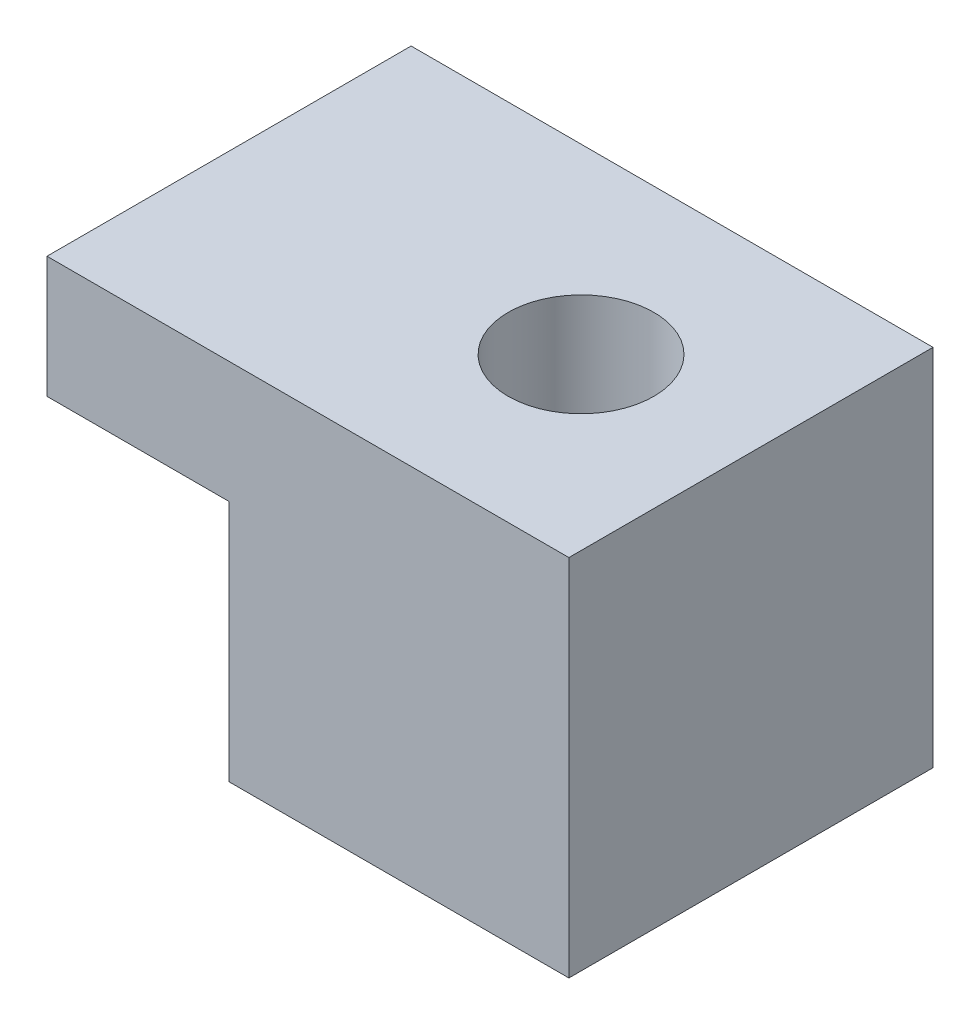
ISO-10303-21;
HEADER;
FILE_DESCRIPTION(('STEP AP214'),'2;1');
FILE_NAME('part.step','',(''),(''),'','','');
FILE_SCHEMA(('AUTOMOTIVE_DESIGN { 1 0 10303 214 1 1 1 1 }'));
ENDSEC;
DATA;
#1=APPLICATION_CONTEXT('core data for automotive mechanical design processes');
#2=APPLICATION_PROTOCOL_DEFINITION('international standard','automotive_design',2000,#1);
#3=PRODUCT_CONTEXT('',#1,'mechanical');
#4=PRODUCT('Part','Part','',(#3));
#5=PRODUCT_RELATED_PRODUCT_CATEGORY('part','',(#4));
#6=PRODUCT_DEFINITION_FORMATION('','',#4);
#7=PRODUCT_DEFINITION_CONTEXT('part definition',#1,'design');
#8=PRODUCT_DEFINITION('design','',#6,#7);
#9=PRODUCT_DEFINITION_SHAPE('','',#8);
#10=(LENGTH_UNIT() NAMED_UNIT(*) SI_UNIT(.MILLI.,.METRE.));
#11=(NAMED_UNIT(*) PLANE_ANGLE_UNIT() SI_UNIT($,.RADIAN.));
#12=(NAMED_UNIT(*) SI_UNIT($,.STERADIAN.) SOLID_ANGLE_UNIT());
#13=UNCERTAINTY_MEASURE_WITH_UNIT(LENGTH_MEASURE(1.E-05),#10,'distance_accuracy_value','');
#14=(GEOMETRIC_REPRESENTATION_CONTEXT(3) GLOBAL_UNCERTAINTY_ASSIGNED_CONTEXT((#13)) GLOBAL_UNIT_ASSIGNED_CONTEXT((#10,
#11,#12)) REPRESENTATION_CONTEXT('',''));
#15=CARTESIAN_POINT('',(0.,0.,0.));
#16=DIRECTION('',(0.,0.,1.));
#17=DIRECTION('',(1.,0.,0.));
#18=AXIS2_PLACEMENT_3D('',#15,#16,#17);
#19=CARTESIAN_POINT('',(14.0000000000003,-2.99760216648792E-12,7.49999999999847));
#20=DIRECTION('',(0.,1.,0.));
#21=DIRECTION('',(-1.,0.,0.));
#22=AXIS2_PLACEMENT_3D('',#19,#20,#21);
#23=PLANE('',#22);
#24=CARTESIAN_POINT('',(6.99999999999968,0.,-1.52655665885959E-12));
#25=DIRECTION('',(0.,1.,0.));
#26=DIRECTION('',(0.,0.,1.));
#27=AXIS2_PLACEMENT_3D('',#24,#25,#26);
#28=CIRCLE('',#27,3.);
#29=CARTESIAN_POINT('',(6.99999999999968,0.,2.99999999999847));
#30=VERTEX_POINT('',#29);
#31=EDGE_CURVE('E86',#30,#30,#28,.T.);
#32=ORIENTED_EDGE('',*,*,#31,.T.);
#33=EDGE_LOOP('',(#32));
#34=FACE_BOUND('',#33,.T.);
#35=DIRECTION('',(1.,0.,0.));
#36=VECTOR('',#35,1.);
#37=CARTESIAN_POINT('',(14.,-2.38697950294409E-12,-7.50000000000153));
#38=LINE('',#37,#36);
#39=CARTESIAN_POINT('',(-1.73472347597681E-13,-7.21644966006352E-13,-7.5));
#40=VERTEX_POINT('',#39);
#41=CARTESIAN_POINT('',(14.,-2.38697950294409E-12,-7.50000000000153));
#42=VERTEX_POINT('',#41);
#43=EDGE_CURVE('E72',#40,#42,#38,.T.);
#44=ORIENTED_EDGE('',*,*,#43,.T.);
#45=DIRECTION('',(0.,0.,-1.));
#46=VECTOR('',#45,1.);
#47=CARTESIAN_POINT('',(14.0000000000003,-2.99760216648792E-12,7.49999999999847));
#48=LINE('',#47,#46);
#49=CARTESIAN_POINT('',(14.0000000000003,-2.99760216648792E-12,7.49999999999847));
#50=VERTEX_POINT('',#49);
#51=EDGE_CURVE('E11',#50,#42,#48,.T.);
#52=ORIENTED_EDGE('',*,*,#51,.F.);
#53=DIRECTION('',(1.,0.,0.));
#54=VECTOR('',#53,1.);
#55=CARTESIAN_POINT('',(14.0000000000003,-2.99760216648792E-12,7.49999999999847));
#56=LINE('',#55,#54);
#57=CARTESIAN_POINT('',(0.,-1.38777878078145E-12,7.5));
#58=VERTEX_POINT('',#57);
#59=EDGE_CURVE('E100',#58,#50,#56,.T.);
#60=ORIENTED_EDGE('',*,*,#59,.F.);
#61=DIRECTION('',(0.,0.,-1.));
#62=VECTOR('',#61,1.);
#63=CARTESIAN_POINT('',(0.,-1.38777878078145E-12,7.5));
#64=LINE('',#63,#62);
#65=EDGE_CURVE('E85',#58,#40,#64,.T.);
#66=ORIENTED_EDGE('',*,*,#65,.T.);
#67=EDGE_LOOP('',(#44,#52,#60,#66));
#68=FACE_BOUND('',#67,.T.);
#69=ADVANCED_FACE('F16',(#34,#68),#23,.F.);
#70=CARTESIAN_POINT('',(14.0000000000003,14.9999999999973,7.49999999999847));
#71=DIRECTION('',(-1.,0.,0.));
#72=DIRECTION('',(0.,0.,1.));
#73=AXIS2_PLACEMENT_3D('',#70,#71,#72);
#74=PLANE('',#73);
#75=DIRECTION('',(0.,1.,0.));
#76=VECTOR('',#75,1.);
#77=CARTESIAN_POINT('',(13.9999999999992,14.9999999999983,-7.50000000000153));
#78=LINE('',#77,#76);
#79=CARTESIAN_POINT('',(13.9999999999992,14.9999999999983,-7.50000000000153));
#80=VERTEX_POINT('',#79);
#81=EDGE_CURVE('E68',#42,#80,#78,.T.);
#82=ORIENTED_EDGE('',*,*,#81,.T.);
#83=DIRECTION('',(0.,0.,-1.));
#84=VECTOR('',#83,1.);
#85=CARTESIAN_POINT('',(14.0000000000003,14.9999999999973,7.49999999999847));
#86=LINE('',#85,#84);
#87=CARTESIAN_POINT('',(14.0000000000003,14.9999999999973,7.49999999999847));
#88=VERTEX_POINT('',#87);
#89=EDGE_CURVE('E23',#88,#80,#86,.T.);
#90=ORIENTED_EDGE('',*,*,#89,.F.);
#91=DIRECTION('',(0.,1.,0.));
#92=VECTOR('',#91,1.);
#93=CARTESIAN_POINT('',(14.0000000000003,14.9999999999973,7.49999999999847));
#94=LINE('',#93,#92);
#95=EDGE_CURVE('E81',#50,#88,#94,.T.);
#96=ORIENTED_EDGE('',*,*,#95,.F.);
#97=ORIENTED_EDGE('',*,*,#51,.T.);
#98=EDGE_LOOP('',(#82,#90,#96,#97));
#99=FACE_BOUND('',#98,.T.);
#100=ADVANCED_FACE('F80',(#99),#74,.F.);
#101=CARTESIAN_POINT('',(-7.50000000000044,14.999999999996,7.49999999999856));
#102=DIRECTION('',(0.,-1.,0.));
#103=DIRECTION('',(0.,0.,-1.));
#104=AXIS2_PLACEMENT_3D('',#101,#102,#103);
#105=PLANE('',#104);
#106=CARTESIAN_POINT('',(6.99999999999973,14.9999999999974,-2.96984659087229E-12));
#107=DIRECTION('',(0.,1.,0.));
#108=DIRECTION('',(0.,0.,1.));
#109=AXIS2_PLACEMENT_3D('',#106,#107,#108);
#110=CIRCLE('',#109,3.);
#111=CARTESIAN_POINT('',(6.99999999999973,14.9999999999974,2.99999999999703));
#112=VERTEX_POINT('',#111);
#113=EDGE_CURVE('E89',#112,#112,#110,.T.);
#114=ORIENTED_EDGE('',*,*,#113,.F.);
#115=EDGE_LOOP('',(#114));
#116=FACE_BOUND('',#115,.T.);
#117=DIRECTION('',(-1.,0.,0.));
#118=VECTOR('',#117,1.);
#119=CARTESIAN_POINT('',(-7.50000000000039,14.999999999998,-7.50000000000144));
#120=LINE('',#119,#118);
#121=CARTESIAN_POINT('',(-7.50000000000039,14.999999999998,-7.50000000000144));
#122=VERTEX_POINT('',#121);
#123=EDGE_CURVE('E74',#80,#122,#120,.T.);
#124=ORIENTED_EDGE('',*,*,#123,.T.);
#125=DIRECTION('',(0.,0.,-1.));
#126=VECTOR('',#125,1.);
#127=CARTESIAN_POINT('',(-7.50000000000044,14.999999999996,7.49999999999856));
#128=LINE('',#127,#126);
#129=CARTESIAN_POINT('',(-7.50000000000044,14.999999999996,7.49999999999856));
#130=VERTEX_POINT('',#129);
#131=EDGE_CURVE('E116',#130,#122,#128,.T.);
#132=ORIENTED_EDGE('',*,*,#131,.F.);
#133=DIRECTION('',(-1.,0.,0.));
#134=VECTOR('',#133,1.);
#135=CARTESIAN_POINT('',(-7.50000000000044,14.999999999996,7.49999999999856));
#136=LINE('',#135,#134);
#137=EDGE_CURVE('E103',#88,#130,#136,.T.);
#138=ORIENTED_EDGE('',*,*,#137,.F.);
#139=ORIENTED_EDGE('',*,*,#89,.T.);
#140=EDGE_LOOP('',(#124,#132,#138,#139));
#141=FACE_BOUND('',#140,.T.);
#142=ADVANCED_FACE('F120',(#116,#141),#105,.F.);
#143=CARTESIAN_POINT('',(-7.49999999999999,9.99999999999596,7.49999999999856));
#144=DIRECTION('',(1.,0.,0.));
#145=DIRECTION('',(0.,1.,0.));
#146=AXIS2_PLACEMENT_3D('',#143,#144,#145);
#147=PLANE('',#146);
#148=DIRECTION('',(0.,-1.,0.));
#149=VECTOR('',#148,1.);
#150=CARTESIAN_POINT('',(-7.49999999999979,9.99999999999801,-7.50000000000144));
#151=LINE('',#150,#149);
#152=CARTESIAN_POINT('',(-7.49999999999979,9.99999999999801,-7.50000000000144));
#153=VERTEX_POINT('',#152);
#154=EDGE_CURVE('E94',#122,#153,#151,.T.);
#155=ORIENTED_EDGE('',*,*,#154,.T.);
#156=DIRECTION('',(0.,0.,-1.));
#157=VECTOR('',#156,1.);
#158=CARTESIAN_POINT('',(-7.49999999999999,9.99999999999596,7.49999999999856));
#159=LINE('',#158,#157);
#160=CARTESIAN_POINT('',(-7.49999999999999,9.99999999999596,7.49999999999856));
#161=VERTEX_POINT('',#160);
#162=EDGE_CURVE('E113',#161,#153,#159,.T.);
#163=ORIENTED_EDGE('',*,*,#162,.F.);
#164=DIRECTION('',(0.,-1.,0.));
#165=VECTOR('',#164,1.);
#166=CARTESIAN_POINT('',(-7.49999999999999,9.99999999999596,7.49999999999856));
#167=LINE('',#166,#165);
#168=EDGE_CURVE('E105',#130,#161,#167,.T.);
#169=ORIENTED_EDGE('',*,*,#168,.F.);
#170=ORIENTED_EDGE('',*,*,#131,.T.);
#171=EDGE_LOOP('',(#155,#163,#169,#170));
#172=FACE_BOUND('',#171,.T.);
#173=ADVANCED_FACE('F126',(#172),#147,.F.);
#174=CARTESIAN_POINT('',(-3.40005801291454E-13,9.99999999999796,7.49999999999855));
#175=DIRECTION('',(0.,1.,0.));
#176=DIRECTION('',(-1.,0.,0.));
#177=AXIS2_PLACEMENT_3D('',#174,#175,#176);
#178=PLANE('',#177);
#179=DIRECTION('',(1.,0.,0.));
#180=VECTOR('',#179,1.);
#181=CARTESIAN_POINT('',(-1.52655665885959E-13,9.99999999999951,-7.50000000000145));
#182=LINE('',#181,#180);
#183=CARTESIAN_POINT('',(-1.52655665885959E-13,9.99999999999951,-7.50000000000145));
#184=VERTEX_POINT('',#183);
#185=EDGE_CURVE('E96',#153,#184,#182,.T.);
#186=ORIENTED_EDGE('',*,*,#185,.T.);
#187=DIRECTION('',(0.,0.,-1.));
#188=VECTOR('',#187,1.);
#189=CARTESIAN_POINT('',(-3.40005801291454E-13,9.99999999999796,7.49999999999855));
#190=LINE('',#189,#188);
#191=CARTESIAN_POINT('',(-3.40005801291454E-13,9.99999999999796,7.49999999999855));
#192=VERTEX_POINT('',#191);
#193=EDGE_CURVE('E110',#192,#184,#190,.T.);
#194=ORIENTED_EDGE('',*,*,#193,.F.);
#195=DIRECTION('',(1.,0.,0.));
#196=VECTOR('',#195,1.);
#197=CARTESIAN_POINT('',(-3.40005801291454E-13,9.99999999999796,7.49999999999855));
#198=LINE('',#197,#196);
#199=EDGE_CURVE('E35',#161,#192,#198,.T.);
#200=ORIENTED_EDGE('',*,*,#199,.F.);
#201=ORIENTED_EDGE('',*,*,#162,.T.);
#202=EDGE_LOOP('',(#186,#194,#200,#201));
#203=FACE_BOUND('',#202,.T.);
#204=ADVANCED_FACE('F129',(#203),#178,.F.);
#205=CARTESIAN_POINT('',(0.,-1.38777878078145E-12,7.5));
#206=DIRECTION('',(1.,0.,0.));
#207=DIRECTION('',(0.,0.,-1.));
#208=AXIS2_PLACEMENT_3D('',#205,#206,#207);
#209=PLANE('',#208);
#210=DIRECTION('',(0.,-1.,0.));
#211=VECTOR('',#210,1.);
#212=CARTESIAN_POINT('',(-1.73472347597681E-13,-7.21644966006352E-13,-7.5));
#213=LINE('',#212,#211);
#214=EDGE_CURVE('E98',#184,#40,#213,.T.);
#215=ORIENTED_EDGE('',*,*,#214,.T.);
#216=ORIENTED_EDGE('',*,*,#65,.F.);
#217=DIRECTION('',(0.,-1.,0.));
#218=VECTOR('',#217,1.);
#219=CARTESIAN_POINT('',(0.,-1.38777878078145E-12,7.5));
#220=LINE('',#219,#218);
#221=EDGE_CURVE('E30',#192,#58,#220,.T.);
#222=ORIENTED_EDGE('',*,*,#221,.F.);
#223=ORIENTED_EDGE('',*,*,#193,.T.);
#224=EDGE_LOOP('',(#215,#216,#222,#223));
#225=FACE_BOUND('',#224,.T.);
#226=ADVANCED_FACE('F131',(#225),#209,.F.);
#227=CARTESIAN_POINT('',(0.,-1.38777878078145E-12,7.5));
#228=DIRECTION('',(0.,0.,-1.));
#229=DIRECTION('',(-1.,0.,0.));
#230=AXIS2_PLACEMENT_3D('',#227,#228,#229);
#231=PLANE('',#230);
#232=ORIENTED_EDGE('',*,*,#59,.T.);
#233=ORIENTED_EDGE('',*,*,#95,.T.);
#234=ORIENTED_EDGE('',*,*,#137,.T.);
#235=ORIENTED_EDGE('',*,*,#168,.T.);
#236=ORIENTED_EDGE('',*,*,#199,.T.);
#237=ORIENTED_EDGE('',*,*,#221,.T.);
#238=EDGE_LOOP('',(#232,#233,#234,#235,#236,#237));
#239=FACE_BOUND('',#238,.T.);
#240=ADVANCED_FACE('F123',(#239),#231,.F.);
#241=CARTESIAN_POINT('',(-1.73472347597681E-13,-7.21644966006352E-13,-7.5));
#242=DIRECTION('',(0.,0.,-1.));
#243=DIRECTION('',(-1.,0.,0.));
#244=AXIS2_PLACEMENT_3D('',#241,#242,#243);
#245=PLANE('',#244);
#246=ORIENTED_EDGE('',*,*,#43,.F.);
#247=ORIENTED_EDGE('',*,*,#214,.F.);
#248=ORIENTED_EDGE('',*,*,#185,.F.);
#249=ORIENTED_EDGE('',*,*,#154,.F.);
#250=ORIENTED_EDGE('',*,*,#123,.F.);
#251=ORIENTED_EDGE('',*,*,#81,.F.);
#252=EDGE_LOOP('',(#246,#247,#248,#249,#250,#251));
#253=FACE_BOUND('',#252,.T.);
#254=ADVANCED_FACE('F69',(#253),#245,.T.);
#255=CARTESIAN_POINT('',(6.99999999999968,0.,-1.52655665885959E-12));
#256=DIRECTION('',(0.,1.,0.));
#257=DIRECTION('',(0.,0.,1.));
#258=AXIS2_PLACEMENT_3D('',#255,#256,#257);
#259=CYLINDRICAL_SURFACE('',#258,3.);
#260=ORIENTED_EDGE('',*,*,#31,.F.);
#261=EDGE_LOOP('',(#260));
#262=FACE_BOUND('',#261,.T.);
#263=ORIENTED_EDGE('',*,*,#113,.T.);
#264=EDGE_LOOP('',(#263));
#265=FACE_BOUND('',#264,.T.);
#266=ADVANCED_FACE('F148',(#262,#265),#259,.F.);
#267=CLOSED_SHELL('',(#69,#100,#142,#173,#204,#226,#240,#254,#266));
#268=MANIFOLD_SOLID_BREP('B1',#267);
#269=ADVANCED_BREP_SHAPE_REPRESENTATION('',(#18,#268),#14);
#270=SHAPE_DEFINITION_REPRESENTATION(#9,#269);
ENDSEC;
END-ISO-10303-21;
